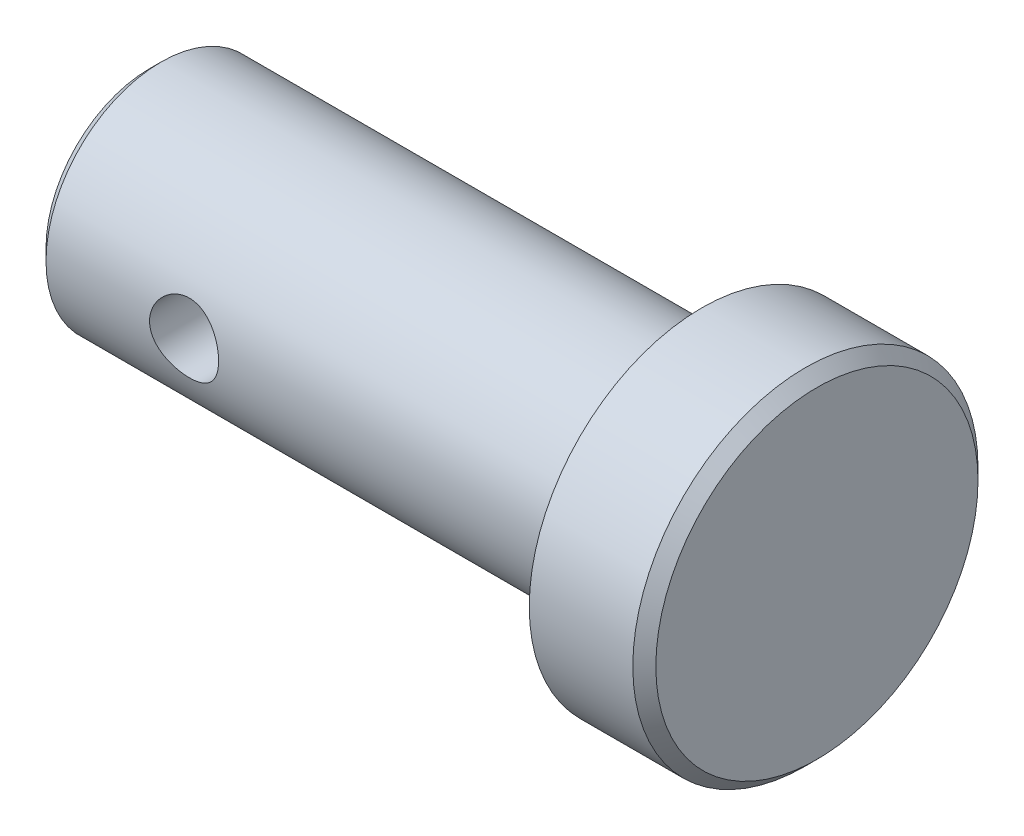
from build123d import *

# Parameters (mm, degrees)
BOSS_EXTRUDE1_START = 2
SKETCH1_R           = 15
BOSS_EXTRUDE1_DEPTH = 10
SKETCH2_R           = 10
BOSS_EXTRUDE2_DEPTH = 48
CHAMFER2_SIZE       = 1
SKETCH3_R           = 3
CUT_EXTRUDE1_DEPTH  = 24


with BuildPart() as part:
    # Sketch1 → Boss-Extrude1 (new body)
    with BuildSketch(Plane(origin=(0, 0, 0), x_dir=(0, 0, -1), z_dir=(1, 0, 0)).offset(BOSS_EXTRUDE1_START)):
        Circle(SKETCH1_R)
    extrude(amount=BOSS_EXTRUDE1_DEPTH)

    # Sketch2 → Boss-Extrude2 (add)
    with BuildSketch(Plane.ZY.offset(-2)):
        with Locations(Location((0, 0, 0), (0, 0, 180))):
            Circle(SKETCH2_R)
    extrude(amount=BOSS_EXTRUDE2_DEPTH)

    # Chamfer2
    chamfer2_edges = [part.edges().sort_by_distance(p)[0] for p in [
        (12, 0, 15),
        (-46, 0, 10),
    ]]
    chamfer(chamfer2_edges, length=CHAMFER2_SIZE)

    # Sketch3 → Cut-Extrude1 (cut, symmetric)
    with BuildSketch(Plane.XY):
        with Locations((-33, 0)):
            Circle(SKETCH3_R)
    extrude(amount=CUT_EXTRUDE1_DEPTH, both=True, mode=Mode.SUBTRACT)


solid = part.part
